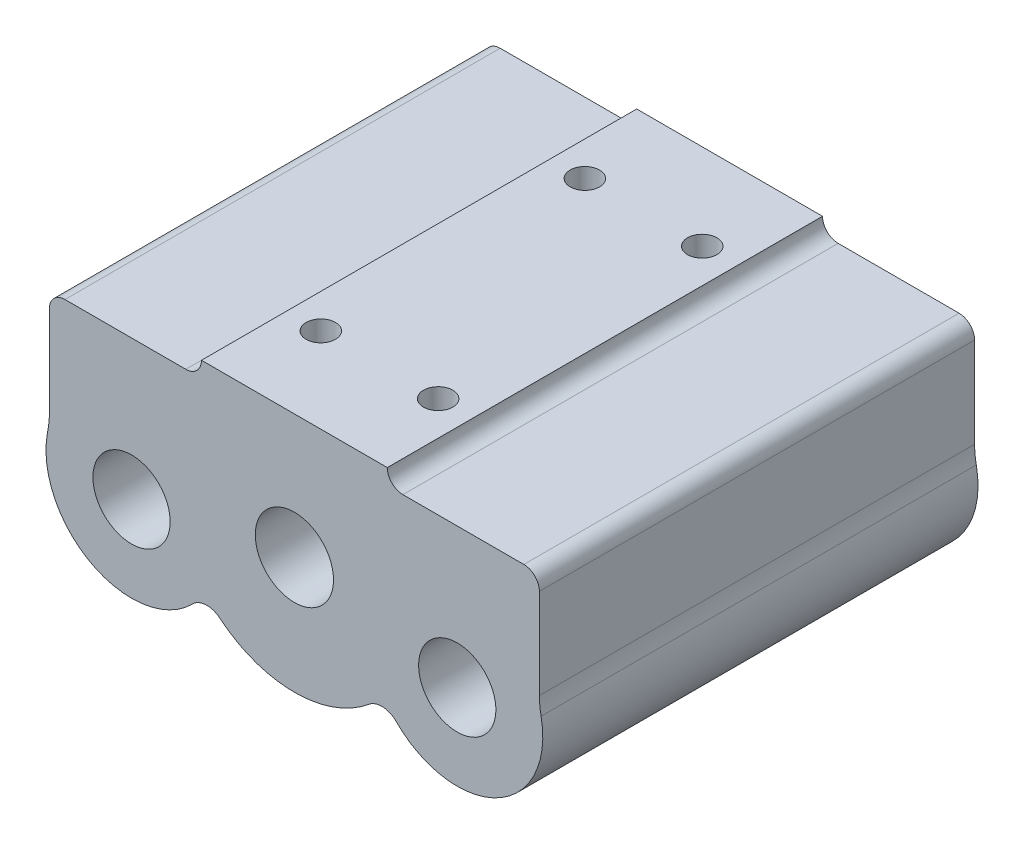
ISO-10303-21;
HEADER;
FILE_DESCRIPTION(('STEP AP214'),'2;1');
FILE_NAME('part.step','',(''),(''),'','','');
FILE_SCHEMA(('AUTOMOTIVE_DESIGN { 1 0 10303 214 1 1 1 1 }'));
ENDSEC;
DATA;
#1=APPLICATION_CONTEXT('core data for automotive mechanical design processes');
#2=APPLICATION_PROTOCOL_DEFINITION('international standard','automotive_design',2000,#1);
#3=PRODUCT_CONTEXT('',#1,'mechanical');
#4=PRODUCT('Part','Part','',(#3));
#5=PRODUCT_RELATED_PRODUCT_CATEGORY('part','',(#4));
#6=PRODUCT_DEFINITION_FORMATION('','',#4);
#7=PRODUCT_DEFINITION_CONTEXT('part definition',#1,'design');
#8=PRODUCT_DEFINITION('design','',#6,#7);
#9=PRODUCT_DEFINITION_SHAPE('','',#8);
#10=(LENGTH_UNIT() NAMED_UNIT(*) SI_UNIT(.MILLI.,.METRE.));
#11=(NAMED_UNIT(*) PLANE_ANGLE_UNIT() SI_UNIT($,.RADIAN.));
#12=(NAMED_UNIT(*) SI_UNIT($,.STERADIAN.) SOLID_ANGLE_UNIT());
#13=UNCERTAINTY_MEASURE_WITH_UNIT(LENGTH_MEASURE(1.E-05),#10,'distance_accuracy_value','');
#14=(GEOMETRIC_REPRESENTATION_CONTEXT(3) GLOBAL_UNCERTAINTY_ASSIGNED_CONTEXT((#13)) GLOBAL_UNIT_ASSIGNED_CONTEXT((#10,
#11,#12)) REPRESENTATION_CONTEXT('',''));
#15=CARTESIAN_POINT('',(0.,0.,0.));
#16=DIRECTION('',(0.,0.,1.));
#17=DIRECTION('',(1.,0.,0.));
#18=AXIS2_PLACEMENT_3D('',#15,#16,#17);
#19=CARTESIAN_POINT('',(0.015142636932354,9.47150974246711E-11,-458.552500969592));
#20=DIRECTION('',(0.,0.,1.));
#21=DIRECTION('',(1.,0.,0.));
#22=AXIS2_PLACEMENT_3D('',#19,#20,#21);
#23=CYLINDRICAL_SURFACE('',#22,4.);
#24=CARTESIAN_POINT('',(0.015142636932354,9.47150974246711E-11,-414.050500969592));
#25=DIRECTION('',(0.,0.,1.));
#26=DIRECTION('',(1.,0.,0.));
#27=AXIS2_PLACEMENT_3D('',#24,#25,#26);
#28=CIRCLE('',#27,4.);
#29=CARTESIAN_POINT('',(4.01514263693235,9.47150974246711E-11,-414.050500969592));
#30=VERTEX_POINT('',#29);
#31=EDGE_CURVE('E309',#30,#30,#28,.T.);
#32=ORIENTED_EDGE('',*,*,#31,.T.);
#33=EDGE_LOOP('',(#32));
#34=FACE_BOUND('',#33,.T.);
#35=CARTESIAN_POINT('',(0.015142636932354,9.47150974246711E-11,-436.300500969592));
#36=DIRECTION('',(0.,0.,-1.));
#37=DIRECTION('',(-1.,0.,0.));
#38=AXIS2_PLACEMENT_3D('',#35,#36,#37);
#39=CIRCLE('',#38,4.);
#40=CARTESIAN_POINT('',(-3.98485736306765,9.47150974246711E-11,-436.300500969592));
#41=VERTEX_POINT('',#40);
#42=EDGE_CURVE('E11',#41,#41,#39,.F.);
#43=ORIENTED_EDGE('',*,*,#42,.F.);
#44=EDGE_LOOP('',(#43));
#45=FACE_BOUND('',#44,.T.);
#46=ADVANCED_FACE('F36',(#34,#45),#23,.F.);
#47=CARTESIAN_POINT('',(-33.7848573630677,0.282456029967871,-515.017202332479));
#48=DIRECTION('',(0.,0.,1.));
#49=DIRECTION('',(1.,0.,0.));
#50=AXIS2_PLACEMENT_3D('',#47,#48,#49);
#51=CYLINDRICAL_SURFACE('',#50,8.75000000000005);
#52=CARTESIAN_POINT('',(-33.7848573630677,0.282456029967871,-458.552500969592));
#53=DIRECTION('',(0.,0.,1.));
#54=DIRECTION('',(1.,0.,0.));
#55=AXIS2_PLACEMENT_3D('',#52,#53,#54);
#56=CIRCLE('',#55,8.75000000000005);
#57=CARTESIAN_POINT('',(-25.2098573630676,-1.45877198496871,-458.552500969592));
#58=VERTEX_POINT('',#57);
#59=CARTESIAN_POINT('',(-25.0348573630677,0.282456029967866,-458.552500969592));
#60=VERTEX_POINT('',#59);
#61=EDGE_CURVE('E137',#58,#60,#56,.T.);
#62=ORIENTED_EDGE('',*,*,#61,.F.);
#63=DIRECTION('',(0.,0.,1.));
#64=VECTOR('',#63,1.);
#65=CARTESIAN_POINT('',(-25.2098573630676,-1.45877198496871,-515.017202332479));
#66=LINE('',#65,#64);
#67=CARTESIAN_POINT('',(-25.2098573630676,-1.45877198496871,-414.050500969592));
#68=VERTEX_POINT('',#67);
#69=EDGE_CURVE('E134',#58,#68,#66,.T.);
#70=ORIENTED_EDGE('',*,*,#69,.T.);
#71=CARTESIAN_POINT('',(-33.7848573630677,0.282456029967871,-414.050500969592));
#72=DIRECTION('',(0.,0.,-1.));
#73=DIRECTION('',(-1.,0.,0.));
#74=AXIS2_PLACEMENT_3D('',#71,#72,#73);
#75=CIRCLE('',#74,8.75000000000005);
#76=CARTESIAN_POINT('',(-25.0348573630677,0.282456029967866,-414.050500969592));
#77=VERTEX_POINT('',#76);
#78=EDGE_CURVE('E145',#77,#68,#75,.T.);
#79=ORIENTED_EDGE('',*,*,#78,.F.);
#80=DIRECTION('',(0.,0.,1.));
#81=VECTOR('',#80,1.);
#82=CARTESIAN_POINT('',(-25.0348573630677,0.282456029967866,-515.017202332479));
#83=LINE('',#82,#81);
#84=EDGE_CURVE('E190',#60,#77,#83,.T.);
#85=ORIENTED_EDGE('',*,*,#84,.F.);
#86=EDGE_LOOP('',(#62,#70,#79,#85));
#87=FACE_BOUND('',#86,.T.);
#88=ADVANCED_FACE('F38',(#87),#51,.F.);
#89=CARTESIAN_POINT('',(-25.0348573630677,0.282456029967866,-515.017202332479));
#90=DIRECTION('',(-1.,0.,0.));
#91=DIRECTION('',(0.,-1.,0.));
#92=AXIS2_PLACEMENT_3D('',#89,#90,#91);
#93=PLANE('',#92);
#94=DIRECTION('',(0.,1.,0.));
#95=VECTOR('',#94,1.);
#96=CARTESIAN_POINT('',(-25.0348573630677,0.282456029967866,-458.552500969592));
#97=LINE('',#96,#95);
#98=CARTESIAN_POINT('',(-25.0348573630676,9.51250000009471,-458.552500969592));
#99=VERTEX_POINT('',#98);
#100=EDGE_CURVE('E138',#60,#99,#97,.T.);
#101=ORIENTED_EDGE('',*,*,#100,.F.);
#102=ORIENTED_EDGE('',*,*,#84,.T.);
#103=DIRECTION('',(0.,-1.,0.));
#104=VECTOR('',#103,1.);
#105=CARTESIAN_POINT('',(-25.0348573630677,0.282456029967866,-414.050500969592));
#106=LINE('',#105,#104);
#107=CARTESIAN_POINT('',(-25.0348573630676,9.51250000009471,-414.050500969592));
#108=VERTEX_POINT('',#107);
#109=EDGE_CURVE('E136',#108,#77,#106,.T.);
#110=ORIENTED_EDGE('',*,*,#109,.F.);
#111=DIRECTION('',(0.,0.,1.));
#112=VECTOR('',#111,1.);
#113=CARTESIAN_POINT('',(-25.0348573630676,9.51250000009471,-515.017202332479));
#114=LINE('',#113,#112);
#115=EDGE_CURVE('E193',#99,#108,#114,.T.);
#116=ORIENTED_EDGE('',*,*,#115,.F.);
#117=EDGE_LOOP('',(#101,#102,#110,#116));
#118=FACE_BOUND('',#117,.T.);
#119=ADVANCED_FACE('F283',(#118),#93,.T.);
#120=CARTESIAN_POINT('',(-23.4473573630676,9.51250000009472,-515.017202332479));
#121=DIRECTION('',(0.,0.,1.));
#122=DIRECTION('',(1.,0.,0.));
#123=AXIS2_PLACEMENT_3D('',#120,#121,#122);
#124=CYLINDRICAL_SURFACE('',#123,1.58749999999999);
#125=CARTESIAN_POINT('',(-23.4473573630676,9.51250000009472,-458.552500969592));
#126=DIRECTION('',(0.,0.,1.));
#127=DIRECTION('',(1.,0.,0.));
#128=AXIS2_PLACEMENT_3D('',#125,#126,#127);
#129=CIRCLE('',#128,1.58749999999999);
#130=CARTESIAN_POINT('',(-23.4473573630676,11.1000000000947,-458.552500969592));
#131=VERTEX_POINT('',#130);
#132=EDGE_CURVE('E141',#99,#131,#129,.F.);
#133=ORIENTED_EDGE('',*,*,#132,.F.);
#134=ORIENTED_EDGE('',*,*,#115,.T.);
#135=CARTESIAN_POINT('',(-23.4473573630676,9.51250000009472,-414.050500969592));
#136=DIRECTION('',(0.,0.,1.));
#137=DIRECTION('',(-1.,0.,0.));
#138=AXIS2_PLACEMENT_3D('',#135,#136,#137);
#139=CIRCLE('',#138,1.58749999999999);
#140=CARTESIAN_POINT('',(-23.4473573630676,11.1000000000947,-414.050500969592));
#141=VERTEX_POINT('',#140);
#142=EDGE_CURVE('E185',#141,#108,#139,.T.);
#143=ORIENTED_EDGE('',*,*,#142,.F.);
#144=DIRECTION('',(0.,0.,1.));
#145=VECTOR('',#144,1.);
#146=CARTESIAN_POINT('',(-23.4473573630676,11.1000000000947,-515.017202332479));
#147=LINE('',#146,#145);
#148=EDGE_CURVE('E196',#131,#141,#147,.T.);
#149=ORIENTED_EDGE('',*,*,#148,.F.);
#150=EDGE_LOOP('',(#133,#134,#143,#149));
#151=FACE_BOUND('',#150,.T.);
#152=ADVANCED_FACE('F286',(#151),#124,.T.);
#153=CARTESIAN_POINT('',(-23.4473573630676,11.1000000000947,-515.017202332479));
#154=DIRECTION('',(0.,1.,0.));
#155=DIRECTION('',(-1.,0.,0.));
#156=AXIS2_PLACEMENT_3D('',#153,#154,#155);
#157=PLANE('',#156);
#158=DIRECTION('',(1.,0.,0.));
#159=VECTOR('',#158,1.);
#160=CARTESIAN_POINT('',(-23.4473573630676,11.1000000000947,-458.552500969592));
#161=LINE('',#160,#159);
#162=CARTESIAN_POINT('',(-11.0848573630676,11.1000000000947,-458.552500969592));
#163=VERTEX_POINT('',#162);
#164=EDGE_CURVE('E289',#131,#163,#161,.T.);
#165=ORIENTED_EDGE('',*,*,#164,.F.);
#166=ORIENTED_EDGE('',*,*,#148,.T.);
#167=DIRECTION('',(-1.,0.,0.));
#168=VECTOR('',#167,1.);
#169=CARTESIAN_POINT('',(-23.4473573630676,11.1000000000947,-414.050500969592));
#170=LINE('',#169,#168);
#171=CARTESIAN_POINT('',(-11.0848573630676,11.1000000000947,-414.050500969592));
#172=VERTEX_POINT('',#171);
#173=EDGE_CURVE('E182',#172,#141,#170,.T.);
#174=ORIENTED_EDGE('',*,*,#173,.F.);
#175=DIRECTION('',(0.,0.,1.));
#176=VECTOR('',#175,1.);
#177=CARTESIAN_POINT('',(-11.0848573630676,11.1000000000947,-515.017202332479));
#178=LINE('',#177,#176);
#179=EDGE_CURVE('E199',#163,#172,#178,.T.);
#180=ORIENTED_EDGE('',*,*,#179,.F.);
#181=EDGE_LOOP('',(#165,#166,#174,#180));
#182=FACE_BOUND('',#181,.T.);
#183=ADVANCED_FACE('F476',(#182),#157,.T.);
#184=CARTESIAN_POINT('',(-11.0848573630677,12.7000000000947,-515.017202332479));
#185=DIRECTION('',(0.,0.,1.));
#186=DIRECTION('',(1.,0.,0.));
#187=AXIS2_PLACEMENT_3D('',#184,#185,#186);
#188=CYLINDRICAL_SURFACE('',#187,1.6);
#189=CARTESIAN_POINT('',(-11.0848573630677,12.7000000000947,-458.552500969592));
#190=DIRECTION('',(0.,0.,1.));
#191=DIRECTION('',(1.,0.,0.));
#192=AXIS2_PLACEMENT_3D('',#189,#190,#191);
#193=CIRCLE('',#192,1.6);
#194=CARTESIAN_POINT('',(-9.48485736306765,12.7000000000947,-458.552500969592));
#195=VERTEX_POINT('',#194);
#196=EDGE_CURVE('E290',#163,#195,#193,.T.);
#197=ORIENTED_EDGE('',*,*,#196,.F.);
#198=ORIENTED_EDGE('',*,*,#179,.T.);
#199=CARTESIAN_POINT('',(-11.0848573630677,12.7000000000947,-414.050500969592));
#200=DIRECTION('',(0.,0.,-1.));
#201=DIRECTION('',(1.,0.,0.));
#202=AXIS2_PLACEMENT_3D('',#199,#200,#201);
#203=CIRCLE('',#202,1.6);
#204=CARTESIAN_POINT('',(-9.48485736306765,12.7000000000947,-414.050500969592));
#205=VERTEX_POINT('',#204);
#206=EDGE_CURVE('E179',#205,#172,#203,.T.);
#207=ORIENTED_EDGE('',*,*,#206,.F.);
#208=DIRECTION('',(0.,0.,1.));
#209=VECTOR('',#208,1.);
#210=CARTESIAN_POINT('',(-9.48485736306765,12.7000000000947,-515.017202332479));
#211=LINE('',#210,#209);
#212=EDGE_CURVE('E202',#195,#205,#211,.T.);
#213=ORIENTED_EDGE('',*,*,#212,.F.);
#214=EDGE_LOOP('',(#197,#198,#207,#213));
#215=FACE_BOUND('',#214,.T.);
#216=ADVANCED_FACE('F398',(#215),#188,.F.);
#217=CARTESIAN_POINT('',(9.51514263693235,12.7000000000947,-515.017202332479));
#218=DIRECTION('',(0.,1.,0.));
#219=DIRECTION('',(-1.,0.,0.));
#220=AXIS2_PLACEMENT_3D('',#217,#218,#219);
#221=PLANE('',#220);
#222=CARTESIAN_POINT('',(-5.98485736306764,12.7000000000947,-422.750500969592));
#223=DIRECTION('',(0.,1.,0.));
#224=DIRECTION('',(0.,0.,1.));
#225=AXIS2_PLACEMENT_3D('',#222,#223,#224);
#226=CIRCLE('',#225,1.5);
#227=CARTESIAN_POINT('',(-5.98485736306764,12.7000000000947,-421.250500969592));
#228=VERTEX_POINT('',#227);
#229=EDGE_CURVE('E360',#228,#228,#226,.T.);
#230=ORIENTED_EDGE('',*,*,#229,.F.);
#231=EDGE_LOOP('',(#230));
#232=FACE_BOUND('',#231,.T.);
#233=CARTESIAN_POINT('',(-5.98485736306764,12.7000000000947,-449.750500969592));
#234=DIRECTION('',(0.,1.,0.));
#235=DIRECTION('',(0.,0.,1.));
#236=AXIS2_PLACEMENT_3D('',#233,#234,#235);
#237=CIRCLE('',#236,1.5);
#238=CARTESIAN_POINT('',(-5.98485736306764,12.7000000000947,-448.250500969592));
#239=VERTEX_POINT('',#238);
#240=EDGE_CURVE('E348',#239,#239,#237,.T.);
#241=ORIENTED_EDGE('',*,*,#240,.F.);
#242=EDGE_LOOP('',(#241));
#243=FACE_BOUND('',#242,.T.);
#244=CARTESIAN_POINT('',(6.01514263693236,12.7000000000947,-449.750500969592));
#245=DIRECTION('',(0.,1.,0.));
#246=DIRECTION('',(0.,0.,1.));
#247=AXIS2_PLACEMENT_3D('',#244,#245,#246);
#248=CIRCLE('',#247,1.5);
#249=CARTESIAN_POINT('',(6.01514263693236,12.7000000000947,-448.250500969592));
#250=VERTEX_POINT('',#249);
#251=EDGE_CURVE('E336',#250,#250,#248,.T.);
#252=ORIENTED_EDGE('',*,*,#251,.F.);
#253=EDGE_LOOP('',(#252));
#254=FACE_BOUND('',#253,.T.);
#255=CARTESIAN_POINT('',(6.01514263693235,12.7000000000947,-422.750500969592));
#256=DIRECTION('',(0.,1.,0.));
#257=DIRECTION('',(0.,0.,1.));
#258=AXIS2_PLACEMENT_3D('',#255,#256,#257);
#259=CIRCLE('',#258,1.5);
#260=CARTESIAN_POINT('',(6.01514263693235,12.7000000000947,-421.250500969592));
#261=VERTEX_POINT('',#260);
#262=EDGE_CURVE('E322',#261,#261,#259,.T.);
#263=ORIENTED_EDGE('',*,*,#262,.F.);
#264=EDGE_LOOP('',(#263));
#265=FACE_BOUND('',#264,.T.);
#266=DIRECTION('',(1.,0.,0.));
#267=VECTOR('',#266,1.);
#268=CARTESIAN_POINT('',(9.51514263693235,12.7000000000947,-458.552500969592));
#269=LINE('',#268,#267);
#270=CARTESIAN_POINT('',(9.51514263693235,12.7000000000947,-458.552500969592));
#271=VERTEX_POINT('',#270);
#272=EDGE_CURVE('E294',#195,#271,#269,.T.);
#273=ORIENTED_EDGE('',*,*,#272,.F.);
#274=ORIENTED_EDGE('',*,*,#212,.T.);
#275=DIRECTION('',(-1.,0.,0.));
#276=VECTOR('',#275,1.);
#277=CARTESIAN_POINT('',(9.51514263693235,12.7000000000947,-414.050500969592));
#278=LINE('',#277,#276);
#279=CARTESIAN_POINT('',(9.51514263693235,12.7000000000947,-414.050500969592));
#280=VERTEX_POINT('',#279);
#281=EDGE_CURVE('E176',#280,#205,#278,.T.);
#282=ORIENTED_EDGE('',*,*,#281,.F.);
#283=DIRECTION('',(0.,0.,1.));
#284=VECTOR('',#283,1.);
#285=CARTESIAN_POINT('',(9.51514263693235,12.7000000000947,-515.017202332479));
#286=LINE('',#285,#284);
#287=EDGE_CURVE('E205',#271,#280,#286,.T.);
#288=ORIENTED_EDGE('',*,*,#287,.F.);
#289=EDGE_LOOP('',(#273,#274,#282,#288));
#290=FACE_BOUND('',#289,.T.);
#291=ADVANCED_FACE('F394',(#232,#243,#254,#265,#290),#221,.T.);
#292=CARTESIAN_POINT('',(11.1151426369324,12.7000000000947,-515.017202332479));
#293=DIRECTION('',(0.,0.,1.));
#294=DIRECTION('',(1.,0.,0.));
#295=AXIS2_PLACEMENT_3D('',#292,#293,#294);
#296=CYLINDRICAL_SURFACE('',#295,1.6);
#297=CARTESIAN_POINT('',(11.1151426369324,12.7000000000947,-458.552500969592));
#298=DIRECTION('',(0.,0.,1.));
#299=DIRECTION('',(1.,0.,0.));
#300=AXIS2_PLACEMENT_3D('',#297,#298,#299);
#301=CIRCLE('',#300,1.6);
#302=CARTESIAN_POINT('',(11.1151426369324,11.1000000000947,-458.552500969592));
#303=VERTEX_POINT('',#302);
#304=EDGE_CURVE('E296',#271,#303,#301,.T.);
#305=ORIENTED_EDGE('',*,*,#304,.F.);
#306=ORIENTED_EDGE('',*,*,#287,.T.);
#307=CARTESIAN_POINT('',(11.1151426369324,12.7000000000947,-414.050500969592));
#308=DIRECTION('',(0.,0.,-1.));
#309=DIRECTION('',(-1.,0.,0.));
#310=AXIS2_PLACEMENT_3D('',#307,#308,#309);
#311=CIRCLE('',#310,1.6);
#312=CARTESIAN_POINT('',(11.1151426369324,11.1000000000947,-414.050500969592));
#313=VERTEX_POINT('',#312);
#314=EDGE_CURVE('E173',#313,#280,#311,.T.);
#315=ORIENTED_EDGE('',*,*,#314,.F.);
#316=DIRECTION('',(0.,0.,1.));
#317=VECTOR('',#316,1.);
#318=CARTESIAN_POINT('',(11.1151426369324,11.1000000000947,-515.017202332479));
#319=LINE('',#318,#317);
#320=EDGE_CURVE('E208',#303,#313,#319,.T.);
#321=ORIENTED_EDGE('',*,*,#320,.F.);
#322=EDGE_LOOP('',(#305,#306,#315,#321));
#323=FACE_BOUND('',#322,.T.);
#324=ADVANCED_FACE('F397',(#323),#296,.F.);
#325=CARTESIAN_POINT('',(23.4776426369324,11.1000000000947,-515.017202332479));
#326=DIRECTION('',(0.,1.,0.));
#327=DIRECTION('',(0.,0.,1.));
#328=AXIS2_PLACEMENT_3D('',#325,#326,#327);
#329=PLANE('',#328);
#330=DIRECTION('',(1.,0.,0.));
#331=VECTOR('',#330,1.);
#332=CARTESIAN_POINT('',(23.4776426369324,11.1000000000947,-458.552500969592));
#333=LINE('',#332,#331);
#334=CARTESIAN_POINT('',(23.4776426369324,11.1000000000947,-458.552500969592));
#335=VERTEX_POINT('',#334);
#336=EDGE_CURVE('E298',#303,#335,#333,.T.);
#337=ORIENTED_EDGE('',*,*,#336,.F.);
#338=ORIENTED_EDGE('',*,*,#320,.T.);
#339=DIRECTION('',(-1.,0.,0.));
#340=VECTOR('',#339,1.);
#341=CARTESIAN_POINT('',(23.4776426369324,11.1000000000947,-414.050500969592));
#342=LINE('',#341,#340);
#343=CARTESIAN_POINT('',(23.4776426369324,11.1000000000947,-414.050500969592));
#344=VERTEX_POINT('',#343);
#345=EDGE_CURVE('E170',#344,#313,#342,.T.);
#346=ORIENTED_EDGE('',*,*,#345,.F.);
#347=DIRECTION('',(0.,0.,1.));
#348=VECTOR('',#347,1.);
#349=CARTESIAN_POINT('',(23.4776426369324,11.1000000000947,-515.017202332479));
#350=LINE('',#349,#348);
#351=EDGE_CURVE('E211',#335,#344,#350,.T.);
#352=ORIENTED_EDGE('',*,*,#351,.F.);
#353=EDGE_LOOP('',(#337,#338,#346,#352));
#354=FACE_BOUND('',#353,.T.);
#355=ADVANCED_FACE('F424',(#354),#329,.T.);
#356=CARTESIAN_POINT('',(23.4776426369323,9.51250000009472,-515.017202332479));
#357=DIRECTION('',(0.,0.,1.));
#358=DIRECTION('',(1.,0.,0.));
#359=AXIS2_PLACEMENT_3D('',#356,#357,#358);
#360=CYLINDRICAL_SURFACE('',#359,1.5875);
#361=CARTESIAN_POINT('',(23.4776426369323,9.51250000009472,-458.552500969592));
#362=DIRECTION('',(0.,0.,1.));
#363=DIRECTION('',(1.,0.,0.));
#364=AXIS2_PLACEMENT_3D('',#361,#362,#363);
#365=CIRCLE('',#364,1.5875);
#366=CARTESIAN_POINT('',(25.0651426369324,9.51250000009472,-458.552500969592));
#367=VERTEX_POINT('',#366);
#368=EDGE_CURVE('E300',#335,#367,#365,.F.);
#369=ORIENTED_EDGE('',*,*,#368,.F.);
#370=ORIENTED_EDGE('',*,*,#351,.T.);
#371=CARTESIAN_POINT('',(23.4776426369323,9.51250000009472,-414.050500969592));
#372=DIRECTION('',(0.,0.,1.));
#373=DIRECTION('',(1.,0.,0.));
#374=AXIS2_PLACEMENT_3D('',#371,#372,#373);
#375=CIRCLE('',#374,1.5875);
#376=CARTESIAN_POINT('',(25.0651426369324,9.51250000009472,-414.050500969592));
#377=VERTEX_POINT('',#376);
#378=EDGE_CURVE('E167',#377,#344,#375,.T.);
#379=ORIENTED_EDGE('',*,*,#378,.F.);
#380=DIRECTION('',(0.,0.,1.));
#381=VECTOR('',#380,1.);
#382=CARTESIAN_POINT('',(25.0651426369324,9.51250000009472,-515.017202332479));
#383=LINE('',#382,#381);
#384=EDGE_CURVE('E214',#367,#377,#383,.T.);
#385=ORIENTED_EDGE('',*,*,#384,.F.);
#386=EDGE_LOOP('',(#369,#370,#379,#385));
#387=FACE_BOUND('',#386,.T.);
#388=ADVANCED_FACE('F427',(#387),#360,.T.);
#389=CARTESIAN_POINT('',(25.0651426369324,0.282456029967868,-515.017202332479));
#390=DIRECTION('',(1.,0.,0.));
#391=DIRECTION('',(0.,1.,0.));
#392=AXIS2_PLACEMENT_3D('',#389,#390,#391);
#393=PLANE('',#392);
#394=DIRECTION('',(0.,-1.,0.));
#395=VECTOR('',#394,1.);
#396=CARTESIAN_POINT('',(25.0651426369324,0.282456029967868,-458.552500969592));
#397=LINE('',#396,#395);
#398=CARTESIAN_POINT('',(25.0651426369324,0.282456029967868,-458.552500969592));
#399=VERTEX_POINT('',#398);
#400=EDGE_CURVE('E302',#367,#399,#397,.T.);
#401=ORIENTED_EDGE('',*,*,#400,.F.);
#402=ORIENTED_EDGE('',*,*,#384,.T.);
#403=DIRECTION('',(0.,1.,0.));
#404=VECTOR('',#403,1.);
#405=CARTESIAN_POINT('',(25.0651426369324,0.282456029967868,-414.050500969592));
#406=LINE('',#405,#404);
#407=CARTESIAN_POINT('',(25.0651426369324,0.282456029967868,-414.050500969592));
#408=VERTEX_POINT('',#407);
#409=EDGE_CURVE('E164',#408,#377,#406,.T.);
#410=ORIENTED_EDGE('',*,*,#409,.F.);
#411=DIRECTION('',(0.,0.,1.));
#412=VECTOR('',#411,1.);
#413=CARTESIAN_POINT('',(25.0651426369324,0.282456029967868,-515.017202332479));
#414=LINE('',#413,#412);
#415=EDGE_CURVE('E217',#399,#408,#414,.T.);
#416=ORIENTED_EDGE('',*,*,#415,.F.);
#417=EDGE_LOOP('',(#401,#402,#410,#416));
#418=FACE_BOUND('',#417,.T.);
#419=ADVANCED_FACE('F431',(#418),#393,.T.);
#420=CARTESIAN_POINT('',(33.8151426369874,0.282456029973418,-515.017202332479));
#421=DIRECTION('',(0.,0.,1.));
#422=DIRECTION('',(1.,0.,0.));
#423=AXIS2_PLACEMENT_3D('',#420,#421,#422);
#424=CYLINDRICAL_SURFACE('',#423,8.75000000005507);
#425=CARTESIAN_POINT('',(33.8151426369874,0.282456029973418,-458.552500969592));
#426=DIRECTION('',(0.,0.,1.));
#427=DIRECTION('',(1.,0.,0.));
#428=AXIS2_PLACEMENT_3D('',#425,#426,#427);
#429=CIRCLE('',#428,8.75000000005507);
#430=CARTESIAN_POINT('',(25.2401426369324,-1.45877198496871,-458.552500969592));
#431=VERTEX_POINT('',#430);
#432=EDGE_CURVE('E304',#399,#431,#429,.T.);
#433=ORIENTED_EDGE('',*,*,#432,.F.);
#434=ORIENTED_EDGE('',*,*,#415,.T.);
#435=CARTESIAN_POINT('',(33.8151426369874,0.282456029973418,-414.050500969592));
#436=DIRECTION('',(0.,0.,-1.));
#437=DIRECTION('',(-1.,0.,0.));
#438=AXIS2_PLACEMENT_3D('',#435,#436,#437);
#439=CIRCLE('',#438,8.75000000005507);
#440=CARTESIAN_POINT('',(25.2401426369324,-1.45877198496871,-414.050500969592));
#441=VERTEX_POINT('',#440);
#442=EDGE_CURVE('E161',#441,#408,#439,.T.);
#443=ORIENTED_EDGE('',*,*,#442,.F.);
#444=DIRECTION('',(0.,0.,1.));
#445=VECTOR('',#444,1.);
#446=CARTESIAN_POINT('',(25.2401426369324,-1.45877198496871,-515.017202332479));
#447=LINE('',#446,#445);
#448=EDGE_CURVE('E126',#431,#441,#447,.T.);
#449=ORIENTED_EDGE('',*,*,#448,.F.);
#450=EDGE_LOOP('',(#433,#434,#443,#449));
#451=FACE_BOUND('',#450,.T.);
#452=ADVANCED_FACE('F231',(#451),#424,.F.);
#453=CARTESIAN_POINT('',(16.6651426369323,-3.19999999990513,-515.017202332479));
#454=DIRECTION('',(0.,0.,1.));
#455=DIRECTION('',(1.,0.,0.));
#456=AXIS2_PLACEMENT_3D('',#453,#454,#455);
#457=CYLINDRICAL_SURFACE('',#456,8.75000000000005);
#458=CARTESIAN_POINT('',(16.6651426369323,-3.19999999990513,-458.552500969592));
#459=DIRECTION('',(0.,0.,1.));
#460=DIRECTION('',(1.,0.,0.));
#461=AXIS2_PLACEMENT_3D('',#458,#459,#460);
#462=CIRCLE('',#461,8.75000000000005);
#463=CARTESIAN_POINT('',(10.4302529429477,-9.33910828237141,-458.552500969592));
#464=VERTEX_POINT('',#463);
#465=EDGE_CURVE('E102',#431,#464,#462,.F.);
#466=ORIENTED_EDGE('',*,*,#465,.F.);
#467=ORIENTED_EDGE('',*,*,#448,.T.);
#468=CARTESIAN_POINT('',(16.6651426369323,-3.19999999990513,-414.050500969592));
#469=DIRECTION('',(0.,0.,1.));
#470=DIRECTION('',(1.,0.,0.));
#471=AXIS2_PLACEMENT_3D('',#468,#469,#470);
#472=CIRCLE('',#471,8.75000000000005);
#473=CARTESIAN_POINT('',(10.4302529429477,-9.33910828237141,-414.050500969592));
#474=VERTEX_POINT('',#473);
#475=EDGE_CURVE('E158',#474,#441,#472,.T.);
#476=ORIENTED_EDGE('',*,*,#475,.F.);
#477=DIRECTION('',(0.,0.,1.));
#478=VECTOR('',#477,1.);
#479=CARTESIAN_POINT('',(10.4302529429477,-9.33910828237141,-515.017202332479));
#480=LINE('',#479,#478);
#481=EDGE_CURVE('E124',#464,#474,#480,.T.);
#482=ORIENTED_EDGE('',*,*,#481,.F.);
#483=EDGE_LOOP('',(#466,#467,#476,#482));
#484=FACE_BOUND('',#483,.T.);
#485=ADVANCED_FACE('F225',(#484),#457,.T.);
#486=CARTESIAN_POINT('',(8.96024409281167,-10.7865346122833,-515.017202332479));
#487=DIRECTION('',(0.,0.,1.));
#488=DIRECTION('',(1.,0.,0.));
#489=AXIS2_PLACEMENT_3D('',#486,#487,#488);
#490=CYLINDRICAL_SURFACE('',#489,2.06300000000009);
#491=CARTESIAN_POINT('',(8.96024409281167,-10.7865346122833,-458.552500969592));
#492=DIRECTION('',(0.,0.,1.));
#493=DIRECTION('',(1.,0.,0.));
#494=AXIS2_PLACEMENT_3D('',#491,#492,#493);
#495=CIRCLE('',#494,2.06300000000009);
#496=CARTESIAN_POINT('',(7.64334233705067,-9.19853626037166,-458.552500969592));
#497=VERTEX_POINT('',#496);
#498=EDGE_CURVE('E96',#464,#497,#495,.T.);
#499=ORIENTED_EDGE('',*,*,#498,.F.);
#500=ORIENTED_EDGE('',*,*,#481,.T.);
#501=CARTESIAN_POINT('',(8.96024409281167,-10.7865346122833,-414.050500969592));
#502=DIRECTION('',(0.,0.,-1.));
#503=DIRECTION('',(-1.,0.,0.));
#504=AXIS2_PLACEMENT_3D('',#501,#502,#503);
#505=CIRCLE('',#504,2.06300000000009);
#506=CARTESIAN_POINT('',(7.64334233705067,-9.19853626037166,-414.050500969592));
#507=VERTEX_POINT('',#506);
#508=EDGE_CURVE('E122',#507,#474,#505,.T.);
#509=ORIENTED_EDGE('',*,*,#508,.F.);
#510=DIRECTION('',(0.,0.,1.));
#511=VECTOR('',#510,1.);
#512=CARTESIAN_POINT('',(7.64334233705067,-9.19853626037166,-515.017202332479));
#513=LINE('',#512,#511);
#514=EDGE_CURVE('E114',#497,#507,#513,.T.);
#515=ORIENTED_EDGE('',*,*,#514,.F.);
#516=EDGE_LOOP('',(#499,#500,#509,#515));
#517=FACE_BOUND('',#516,.T.);
#518=ADVANCED_FACE('F120',(#517),#490,.F.);
#519=CARTESIAN_POINT('',(0.0151426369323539,9.46472417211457E-11,-515.017202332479));
#520=DIRECTION('',(0.,0.,1.));
#521=DIRECTION('',(1.,0.,0.));
#522=AXIS2_PLACEMENT_3D('',#519,#520,#521);
#523=CYLINDRICAL_SURFACE('',#522,11.9499999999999);
#524=CARTESIAN_POINT('',(0.0151426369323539,9.46472417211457E-11,-458.552500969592));
#525=DIRECTION('',(0.,0.,1.));
#526=DIRECTION('',(1.,0.,0.));
#527=AXIS2_PLACEMENT_3D('',#524,#525,#526);
#528=CIRCLE('',#527,11.9499999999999);
#529=CARTESIAN_POINT('',(-7.61305706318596,-9.19853626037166,-458.552500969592));
#530=VERTEX_POINT('',#529);
#531=EDGE_CURVE('E99',#497,#530,#528,.F.);
#532=ORIENTED_EDGE('',*,*,#531,.F.);
#533=ORIENTED_EDGE('',*,*,#514,.T.);
#534=CARTESIAN_POINT('',(0.0151426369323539,9.46472417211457E-11,-414.050500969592));
#535=DIRECTION('',(0.,0.,1.));
#536=DIRECTION('',(1.,0.,0.));
#537=AXIS2_PLACEMENT_3D('',#534,#535,#536);
#538=CIRCLE('',#537,11.9499999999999);
#539=CARTESIAN_POINT('',(-7.61305706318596,-9.19853626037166,-414.050500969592));
#540=VERTEX_POINT('',#539);
#541=EDGE_CURVE('E155',#540,#507,#538,.T.);
#542=ORIENTED_EDGE('',*,*,#541,.F.);
#543=DIRECTION('',(0.,0.,1.));
#544=VECTOR('',#543,1.);
#545=CARTESIAN_POINT('',(-7.61305706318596,-9.19853626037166,-515.017202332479));
#546=LINE('',#545,#544);
#547=EDGE_CURVE('E117',#530,#540,#546,.T.);
#548=ORIENTED_EDGE('',*,*,#547,.F.);
#549=EDGE_LOOP('',(#532,#533,#542,#548));
#550=FACE_BOUND('',#549,.T.);
#551=ADVANCED_FACE('F111',(#550),#523,.T.);
#552=CARTESIAN_POINT('',(-8.92995881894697,-10.7865346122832,-515.017202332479));
#553=DIRECTION('',(0.,0.,1.));
#554=DIRECTION('',(1.,0.,0.));
#555=AXIS2_PLACEMENT_3D('',#552,#553,#554);
#556=CYLINDRICAL_SURFACE('',#555,2.06300000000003);
#557=CARTESIAN_POINT('',(-8.92995881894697,-10.7865346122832,-458.552500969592));
#558=DIRECTION('',(0.,0.,1.));
#559=DIRECTION('',(1.,0.,0.));
#560=AXIS2_PLACEMENT_3D('',#557,#558,#559);
#561=CIRCLE('',#560,2.06300000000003);
#562=CARTESIAN_POINT('',(-10.399967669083,-9.33910828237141,-458.552500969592));
#563=VERTEX_POINT('',#562);
#564=EDGE_CURVE('E118',#530,#563,#561,.T.);
#565=ORIENTED_EDGE('',*,*,#564,.F.);
#566=ORIENTED_EDGE('',*,*,#547,.T.);
#567=CARTESIAN_POINT('',(-8.92995881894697,-10.7865346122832,-414.050500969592));
#568=DIRECTION('',(0.,0.,-1.));
#569=DIRECTION('',(-1.,0.,0.));
#570=AXIS2_PLACEMENT_3D('',#567,#568,#569);
#571=CIRCLE('',#570,2.06300000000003);
#572=CARTESIAN_POINT('',(-10.399967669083,-9.33910828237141,-414.050500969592));
#573=VERTEX_POINT('',#572);
#574=EDGE_CURVE('E152',#573,#540,#571,.T.);
#575=ORIENTED_EDGE('',*,*,#574,.F.);
#576=DIRECTION('',(0.,0.,1.));
#577=VECTOR('',#576,1.);
#578=CARTESIAN_POINT('',(-10.399967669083,-9.33910828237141,-515.017202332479));
#579=LINE('',#578,#577);
#580=EDGE_CURVE('E128',#563,#573,#579,.T.);
#581=ORIENTED_EDGE('',*,*,#580,.F.);
#582=EDGE_LOOP('',(#565,#566,#575,#581));
#583=FACE_BOUND('',#582,.T.);
#584=ADVANCED_FACE('F266',(#583),#556,.F.);
#585=CARTESIAN_POINT('',(-16.6348573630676,-3.19999999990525,-515.017202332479));
#586=DIRECTION('',(0.,0.,1.));
#587=DIRECTION('',(1.,0.,0.));
#588=AXIS2_PLACEMENT_3D('',#585,#586,#587);
#589=CYLINDRICAL_SURFACE('',#588,8.75000000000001);
#590=CARTESIAN_POINT('',(-16.6348573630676,-3.19999999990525,-458.552500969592));
#591=DIRECTION('',(0.,0.,1.));
#592=DIRECTION('',(1.,0.,0.));
#593=AXIS2_PLACEMENT_3D('',#590,#591,#592);
#594=CIRCLE('',#593,8.75000000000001);
#595=EDGE_CURVE('E46',#563,#58,#594,.F.);
#596=ORIENTED_EDGE('',*,*,#595,.F.);
#597=ORIENTED_EDGE('',*,*,#580,.T.);
#598=CARTESIAN_POINT('',(-16.6348573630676,-3.19999999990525,-414.050500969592));
#599=DIRECTION('',(0.,0.,1.));
#600=DIRECTION('',(1.,0.,0.));
#601=AXIS2_PLACEMENT_3D('',#598,#599,#600);
#602=CIRCLE('',#601,8.75000000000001);
#603=EDGE_CURVE('E148',#68,#573,#602,.T.);
#604=ORIENTED_EDGE('',*,*,#603,.F.);
#605=ORIENTED_EDGE('',*,*,#69,.F.);
#606=EDGE_LOOP('',(#596,#597,#604,#605));
#607=FACE_BOUND('',#606,.T.);
#608=ADVANCED_FACE('F271',(#607),#589,.T.);
#609=CARTESIAN_POINT('',(-33.7848573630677,0.282456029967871,-414.050500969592));
#610=DIRECTION('',(0.,0.,-1.));
#611=DIRECTION('',(-1.,0.,0.));
#612=AXIS2_PLACEMENT_3D('',#609,#610,#611);
#613=PLANE('',#612);
#614=CARTESIAN_POINT('',(16.6651426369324,-3.19999999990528,-414.050500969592));
#615=DIRECTION('',(0.,0.,-1.));
#616=DIRECTION('',(-1.,0.,0.));
#617=AXIS2_PLACEMENT_3D('',#614,#615,#616);
#618=CIRCLE('',#617,3.95);
#619=CARTESIAN_POINT('',(12.7151426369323,-3.19999999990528,-414.050500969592));
#620=VERTEX_POINT('',#619);
#621=EDGE_CURVE('E316',#620,#620,#618,.T.);
#622=ORIENTED_EDGE('',*,*,#621,.T.);
#623=EDGE_LOOP('',(#622));
#624=FACE_BOUND('',#623,.T.);
#625=CARTESIAN_POINT('',(-16.6348573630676,-3.19999999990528,-414.050500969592));
#626=DIRECTION('',(0.,0.,-1.));
#627=DIRECTION('',(-1.,0.,0.));
#628=AXIS2_PLACEMENT_3D('',#625,#626,#627);
#629=CIRCLE('',#628,3.95);
#630=CARTESIAN_POINT('',(-20.5848573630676,-3.19999999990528,-414.050500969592));
#631=VERTEX_POINT('',#630);
#632=EDGE_CURVE('E312',#631,#631,#629,.T.);
#633=ORIENTED_EDGE('',*,*,#632,.T.);
#634=EDGE_LOOP('',(#633));
#635=FACE_BOUND('',#634,.T.);
#636=ORIENTED_EDGE('',*,*,#31,.F.);
#637=EDGE_LOOP('',(#636));
#638=FACE_BOUND('',#637,.T.);
#639=ORIENTED_EDGE('',*,*,#78,.T.);
#640=ORIENTED_EDGE('',*,*,#603,.T.);
#641=ORIENTED_EDGE('',*,*,#574,.T.);
#642=ORIENTED_EDGE('',*,*,#541,.T.);
#643=ORIENTED_EDGE('',*,*,#508,.T.);
#644=ORIENTED_EDGE('',*,*,#475,.T.);
#645=ORIENTED_EDGE('',*,*,#442,.T.);
#646=ORIENTED_EDGE('',*,*,#409,.T.);
#647=ORIENTED_EDGE('',*,*,#378,.T.);
#648=ORIENTED_EDGE('',*,*,#345,.T.);
#649=ORIENTED_EDGE('',*,*,#314,.T.);
#650=ORIENTED_EDGE('',*,*,#281,.T.);
#651=ORIENTED_EDGE('',*,*,#206,.T.);
#652=ORIENTED_EDGE('',*,*,#173,.T.);
#653=ORIENTED_EDGE('',*,*,#142,.T.);
#654=ORIENTED_EDGE('',*,*,#109,.T.);
#655=EDGE_LOOP('',(#639,#640,#641,#642,#643,#644,#645,#646,#647,#648,#649,#650,#651,#652,#653,#654));
#656=FACE_BOUND('',#655,.T.);
#657=ADVANCED_FACE('F235',(#624,#635,#638,#656),#613,.F.);
#658=CARTESIAN_POINT('',(0.0151426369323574,9.47150974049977E-11,-458.552500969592));
#659=DIRECTION('',(0.,0.,1.));
#660=DIRECTION('',(1.,0.,0.));
#661=AXIS2_PLACEMENT_3D('',#658,#659,#660);
#662=PLANE('',#661);
#663=CARTESIAN_POINT('',(16.6651426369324,-3.19999999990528,-458.552500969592));
#664=DIRECTION('',(0.,0.,-1.));
#665=DIRECTION('',(-1.,0.,0.));
#666=AXIS2_PLACEMENT_3D('',#663,#664,#665);
#667=CIRCLE('',#666,3.95);
#668=CARTESIAN_POINT('',(12.7151426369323,-3.19999999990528,-458.552500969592));
#669=VERTEX_POINT('',#668);
#670=EDGE_CURVE('E319',#669,#669,#667,.T.);
#671=ORIENTED_EDGE('',*,*,#670,.F.);
#672=EDGE_LOOP('',(#671));
#673=FACE_BOUND('',#672,.T.);
#674=CARTESIAN_POINT('',(-16.6348573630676,-3.19999999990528,-458.552500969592));
#675=DIRECTION('',(0.,0.,-1.));
#676=DIRECTION('',(-1.,0.,0.));
#677=AXIS2_PLACEMENT_3D('',#674,#675,#676);
#678=CIRCLE('',#677,3.95);
#679=CARTESIAN_POINT('',(-20.5848573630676,-3.19999999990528,-458.552500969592));
#680=VERTEX_POINT('',#679);
#681=EDGE_CURVE('E313',#680,#680,#678,.T.);
#682=ORIENTED_EDGE('',*,*,#681,.F.);
#683=EDGE_LOOP('',(#682));
#684=FACE_BOUND('',#683,.T.);
#685=CARTESIAN_POINT('',(0.015142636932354,9.47150974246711E-11,-458.552500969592));
#686=DIRECTION('',(0.,0.,1.));
#687=DIRECTION('',(1.,0.,0.));
#688=AXIS2_PLACEMENT_3D('',#685,#686,#687);
#689=CIRCLE('',#688,4.);
#690=CARTESIAN_POINT('',(4.01514263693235,9.47150974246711E-11,-458.552500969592));
#691=VERTEX_POINT('',#690);
#692=EDGE_CURVE('E149',#691,#691,#689,.T.);
#693=ORIENTED_EDGE('',*,*,#692,.T.);
#694=EDGE_LOOP('',(#693));
#695=FACE_BOUND('',#694,.T.);
#696=ORIENTED_EDGE('',*,*,#61,.T.);
#697=ORIENTED_EDGE('',*,*,#100,.T.);
#698=ORIENTED_EDGE('',*,*,#132,.T.);
#699=ORIENTED_EDGE('',*,*,#164,.T.);
#700=ORIENTED_EDGE('',*,*,#196,.T.);
#701=ORIENTED_EDGE('',*,*,#272,.T.);
#702=ORIENTED_EDGE('',*,*,#304,.T.);
#703=ORIENTED_EDGE('',*,*,#336,.T.);
#704=ORIENTED_EDGE('',*,*,#368,.T.);
#705=ORIENTED_EDGE('',*,*,#400,.T.);
#706=ORIENTED_EDGE('',*,*,#432,.T.);
#707=ORIENTED_EDGE('',*,*,#465,.T.);
#708=ORIENTED_EDGE('',*,*,#498,.T.);
#709=ORIENTED_EDGE('',*,*,#531,.T.);
#710=ORIENTED_EDGE('',*,*,#564,.T.);
#711=ORIENTED_EDGE('',*,*,#595,.T.);
#712=EDGE_LOOP('',(#696,#697,#698,#699,#700,#701,#702,#703,#704,#705,#706,#707,#708,#709,#710,#711));
#713=FACE_BOUND('',#712,.T.);
#714=ADVANCED_FACE('F98',(#673,#684,#695,#713),#662,.F.);
#715=ORIENTED_EDGE('',*,*,#42,.T.);
#716=EDGE_LOOP('',(#715));
#717=FACE_BOUND('',#716,.T.);
#718=ORIENTED_EDGE('',*,*,#692,.F.);
#719=EDGE_LOOP('',(#718));
#720=FACE_BOUND('',#719,.T.);
#721=ADVANCED_FACE('F443',(#717,#720),#23,.F.);
#722=CARTESIAN_POINT('',(-16.6348573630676,-3.19999999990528,-414.050500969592));
#723=DIRECTION('',(0.,0.,-1.));
#724=DIRECTION('',(-1.,0.,0.));
#725=AXIS2_PLACEMENT_3D('',#722,#723,#724);
#726=CYLINDRICAL_SURFACE('',#725,3.95);
#727=ORIENTED_EDGE('',*,*,#632,.F.);
#728=EDGE_LOOP('',(#727));
#729=FACE_BOUND('',#728,.T.);
#730=ORIENTED_EDGE('',*,*,#681,.T.);
#731=EDGE_LOOP('',(#730));
#732=FACE_BOUND('',#731,.T.);
#733=ADVANCED_FACE('F451',(#729,#732),#726,.F.);
#734=CARTESIAN_POINT('',(16.6651426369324,-3.19999999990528,-414.050500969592));
#735=DIRECTION('',(0.,0.,-1.));
#736=DIRECTION('',(-1.,0.,0.));
#737=AXIS2_PLACEMENT_3D('',#734,#735,#736);
#738=CYLINDRICAL_SURFACE('',#737,3.95);
#739=ORIENTED_EDGE('',*,*,#621,.F.);
#740=EDGE_LOOP('',(#739));
#741=FACE_BOUND('',#740,.T.);
#742=ORIENTED_EDGE('',*,*,#670,.T.);
#743=EDGE_LOOP('',(#742));
#744=FACE_BOUND('',#743,.T.);
#745=ADVANCED_FACE('F457',(#741,#744),#738,.F.);
#746=CARTESIAN_POINT('',(6.01514263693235,12.7000000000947,-422.750500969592));
#747=DIRECTION('',(0.,1.,0.));
#748=DIRECTION('',(0.,0.,1.));
#749=AXIS2_PLACEMENT_3D('',#746,#747,#748);
#750=CYLINDRICAL_SURFACE('',#749,1.5);
#751=CARTESIAN_POINT('',(6.01514263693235,6.70000000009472,-422.750500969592));
#752=DIRECTION('',(0.,1.,0.));
#753=DIRECTION('',(0.,0.,1.));
#754=AXIS2_PLACEMENT_3D('',#751,#752,#753);
#755=CIRCLE('',#754,1.5);
#756=CARTESIAN_POINT('',(6.01514263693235,6.70000000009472,-421.250500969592));
#757=VERTEX_POINT('',#756);
#758=EDGE_CURVE('E327',#757,#757,#755,.T.);
#759=ORIENTED_EDGE('',*,*,#758,.F.);
#760=EDGE_LOOP('',(#759));
#761=FACE_BOUND('',#760,.T.);
#762=ORIENTED_EDGE('',*,*,#262,.T.);
#763=EDGE_LOOP('',(#762));
#764=FACE_BOUND('',#763,.T.);
#765=ADVANCED_FACE('F567',(#761,#764),#750,.F.);
#766=CARTESIAN_POINT('',(7.26514263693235,6.70000000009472,-422.750500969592));
#767=DIRECTION('',(0.,-1.,0.));
#768=DIRECTION('',(0.,0.,-1.));
#769=AXIS2_PLACEMENT_3D('',#766,#767,#768);
#770=PLANE('',#769);
#771=CARTESIAN_POINT('',(6.01514263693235,6.70000000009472,-422.750500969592));
#772=DIRECTION('',(0.,1.,0.));
#773=DIRECTION('',(0.,0.,1.));
#774=AXIS2_PLACEMENT_3D('',#771,#772,#773);
#775=CIRCLE('',#774,1.25);
#776=CARTESIAN_POINT('',(6.01514263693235,6.70000000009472,-421.500500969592));
#777=VERTEX_POINT('',#776);
#778=EDGE_CURVE('E330',#777,#777,#775,.T.);
#779=ORIENTED_EDGE('',*,*,#778,.F.);
#780=EDGE_LOOP('',(#779));
#781=FACE_BOUND('',#780,.T.);
#782=ORIENTED_EDGE('',*,*,#758,.T.);
#783=EDGE_LOOP('',(#782));
#784=FACE_BOUND('',#783,.T.);
#785=ADVANCED_FACE('F585',(#781,#784),#770,.F.);
#786=CARTESIAN_POINT('',(6.01514263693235,12.7000000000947,-422.750500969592));
#787=DIRECTION('',(0.,1.,0.));
#788=DIRECTION('',(0.,0.,1.));
#789=AXIS2_PLACEMENT_3D('',#786,#787,#788);
#790=CYLINDRICAL_SURFACE('',#789,1.25);
#791=CARTESIAN_POINT('',(6.01514263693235,4.20000000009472,-422.750500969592));
#792=DIRECTION('',(0.,1.,0.));
#793=DIRECTION('',(0.,0.,1.));
#794=AXIS2_PLACEMENT_3D('',#791,#792,#793);
#795=CIRCLE('',#794,1.25);
#796=CARTESIAN_POINT('',(6.01514263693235,4.20000000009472,-421.500500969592));
#797=VERTEX_POINT('',#796);
#798=EDGE_CURVE('E333',#797,#797,#795,.T.);
#799=ORIENTED_EDGE('',*,*,#798,.F.);
#800=EDGE_LOOP('',(#799));
#801=FACE_BOUND('',#800,.T.);
#802=ORIENTED_EDGE('',*,*,#778,.T.);
#803=EDGE_LOOP('',(#802));
#804=FACE_BOUND('',#803,.T.);
#805=ADVANCED_FACE('F595',(#801,#804),#790,.F.);
#806=CARTESIAN_POINT('',(6.01514263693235,4.20000000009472,-422.750500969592));
#807=DIRECTION('',(0.,1.,0.));
#808=DIRECTION('',(0.,0.,1.));
#809=AXIS2_PLACEMENT_3D('',#806,#807,#808);
#810=CONICAL_SURFACE('',#809,1.25,1.02974425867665);
#811=CARTESIAN_POINT('',(6.01514263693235,3.44892422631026,-422.750500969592));
#812=VERTEX_POINT('',#811);
#813=VERTEX_LOOP('',#812);
#814=FACE_BOUND('',#813,.T.);
#815=ORIENTED_EDGE('',*,*,#798,.T.);
#816=EDGE_LOOP('',(#815));
#817=FACE_BOUND('',#816,.T.);
#818=ADVANCED_FACE('F605',(#814,#817),#810,.F.);
#819=CARTESIAN_POINT('',(6.01514263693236,12.7000000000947,-449.750500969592));
#820=DIRECTION('',(0.,1.,0.));
#821=DIRECTION('',(0.,0.,1.));
#822=AXIS2_PLACEMENT_3D('',#819,#820,#821);
#823=CYLINDRICAL_SURFACE('',#822,1.5);
#824=CARTESIAN_POINT('',(6.01514263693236,6.70000000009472,-449.750500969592));
#825=DIRECTION('',(0.,1.,0.));
#826=DIRECTION('',(0.,0.,1.));
#827=AXIS2_PLACEMENT_3D('',#824,#825,#826);
#828=CIRCLE('',#827,1.5);
#829=CARTESIAN_POINT('',(6.01514263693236,6.70000000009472,-448.250500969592));
#830=VERTEX_POINT('',#829);
#831=EDGE_CURVE('E339',#830,#830,#828,.T.);
#832=ORIENTED_EDGE('',*,*,#831,.F.);
#833=EDGE_LOOP('',(#832));
#834=FACE_BOUND('',#833,.T.);
#835=ORIENTED_EDGE('',*,*,#251,.T.);
#836=EDGE_LOOP('',(#835));
#837=FACE_BOUND('',#836,.T.);
#838=ADVANCED_FACE('F615',(#834,#837),#823,.F.);
#839=CARTESIAN_POINT('',(7.26514263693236,6.70000000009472,-449.750500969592));
#840=DIRECTION('',(0.,-1.,0.));
#841=DIRECTION('',(0.,0.,-1.));
#842=AXIS2_PLACEMENT_3D('',#839,#840,#841);
#843=PLANE('',#842);
#844=CARTESIAN_POINT('',(6.01514263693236,6.70000000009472,-449.750500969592));
#845=DIRECTION('',(0.,1.,0.));
#846=DIRECTION('',(0.,0.,1.));
#847=AXIS2_PLACEMENT_3D('',#844,#845,#846);
#848=CIRCLE('',#847,1.25);
#849=CARTESIAN_POINT('',(6.01514263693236,6.70000000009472,-448.500500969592));
#850=VERTEX_POINT('',#849);
#851=EDGE_CURVE('E342',#850,#850,#848,.T.);
#852=ORIENTED_EDGE('',*,*,#851,.F.);
#853=EDGE_LOOP('',(#852));
#854=FACE_BOUND('',#853,.T.);
#855=ORIENTED_EDGE('',*,*,#831,.T.);
#856=EDGE_LOOP('',(#855));
#857=FACE_BOUND('',#856,.T.);
#858=ADVANCED_FACE('F625',(#854,#857),#843,.F.);
#859=CARTESIAN_POINT('',(6.01514263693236,12.7000000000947,-449.750500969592));
#860=DIRECTION('',(0.,1.,0.));
#861=DIRECTION('',(0.,0.,1.));
#862=AXIS2_PLACEMENT_3D('',#859,#860,#861);
#863=CYLINDRICAL_SURFACE('',#862,1.25);
#864=CARTESIAN_POINT('',(6.01514263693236,4.20000000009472,-449.750500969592));
#865=DIRECTION('',(0.,1.,0.));
#866=DIRECTION('',(0.,0.,1.));
#867=AXIS2_PLACEMENT_3D('',#864,#865,#866);
#868=CIRCLE('',#867,1.25);
#869=CARTESIAN_POINT('',(6.01514263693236,4.20000000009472,-448.500500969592));
#870=VERTEX_POINT('',#869);
#871=EDGE_CURVE('E345',#870,#870,#868,.T.);
#872=ORIENTED_EDGE('',*,*,#871,.F.);
#873=EDGE_LOOP('',(#872));
#874=FACE_BOUND('',#873,.T.);
#875=ORIENTED_EDGE('',*,*,#851,.T.);
#876=EDGE_LOOP('',(#875));
#877=FACE_BOUND('',#876,.T.);
#878=ADVANCED_FACE('F635',(#874,#877),#863,.F.);
#879=CARTESIAN_POINT('',(6.01514263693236,4.20000000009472,-449.750500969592));
#880=DIRECTION('',(0.,1.,0.));
#881=DIRECTION('',(0.,0.,1.));
#882=AXIS2_PLACEMENT_3D('',#879,#880,#881);
#883=CONICAL_SURFACE('',#882,1.25,1.02974425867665);
#884=CARTESIAN_POINT('',(6.01514263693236,3.44892422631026,-449.750500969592));
#885=VERTEX_POINT('',#884);
#886=VERTEX_LOOP('',#885);
#887=FACE_BOUND('',#886,.T.);
#888=ORIENTED_EDGE('',*,*,#871,.T.);
#889=EDGE_LOOP('',(#888));
#890=FACE_BOUND('',#889,.T.);
#891=ADVANCED_FACE('F645',(#887,#890),#883,.F.);
#892=CARTESIAN_POINT('',(-5.98485736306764,12.7000000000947,-449.750500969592));
#893=DIRECTION('',(0.,1.,0.));
#894=DIRECTION('',(0.,0.,1.));
#895=AXIS2_PLACEMENT_3D('',#892,#893,#894);
#896=CYLINDRICAL_SURFACE('',#895,1.5);
#897=CARTESIAN_POINT('',(-5.98485736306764,6.70000000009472,-449.750500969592));
#898=DIRECTION('',(0.,1.,0.));
#899=DIRECTION('',(0.,0.,1.));
#900=AXIS2_PLACEMENT_3D('',#897,#898,#899);
#901=CIRCLE('',#900,1.5);
#902=CARTESIAN_POINT('',(-5.98485736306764,6.70000000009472,-448.250500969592));
#903=VERTEX_POINT('',#902);
#904=EDGE_CURVE('E351',#903,#903,#901,.T.);
#905=ORIENTED_EDGE('',*,*,#904,.F.);
#906=EDGE_LOOP('',(#905));
#907=FACE_BOUND('',#906,.T.);
#908=ORIENTED_EDGE('',*,*,#240,.T.);
#909=EDGE_LOOP('',(#908));
#910=FACE_BOUND('',#909,.T.);
#911=ADVANCED_FACE('F655',(#907,#910),#896,.F.);
#912=CARTESIAN_POINT('',(-4.73485736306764,6.70000000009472,-449.750500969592));
#913=DIRECTION('',(0.,-1.,0.));
#914=DIRECTION('',(0.,0.,-1.));
#915=AXIS2_PLACEMENT_3D('',#912,#913,#914);
#916=PLANE('',#915);
#917=CARTESIAN_POINT('',(-5.98485736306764,6.70000000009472,-449.750500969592));
#918=DIRECTION('',(0.,1.,0.));
#919=DIRECTION('',(0.,0.,1.));
#920=AXIS2_PLACEMENT_3D('',#917,#918,#919);
#921=CIRCLE('',#920,1.25);
#922=CARTESIAN_POINT('',(-5.98485736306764,6.70000000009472,-448.500500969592));
#923=VERTEX_POINT('',#922);
#924=EDGE_CURVE('E354',#923,#923,#921,.T.);
#925=ORIENTED_EDGE('',*,*,#924,.F.);
#926=EDGE_LOOP('',(#925));
#927=FACE_BOUND('',#926,.T.);
#928=ORIENTED_EDGE('',*,*,#904,.T.);
#929=EDGE_LOOP('',(#928));
#930=FACE_BOUND('',#929,.T.);
#931=ADVANCED_FACE('F665',(#927,#930),#916,.F.);
#932=CARTESIAN_POINT('',(-5.98485736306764,12.7000000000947,-449.750500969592));
#933=DIRECTION('',(0.,1.,0.));
#934=DIRECTION('',(0.,0.,1.));
#935=AXIS2_PLACEMENT_3D('',#932,#933,#934);
#936=CYLINDRICAL_SURFACE('',#935,1.25);
#937=CARTESIAN_POINT('',(-5.98485736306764,4.20000000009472,-449.750500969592));
#938=DIRECTION('',(0.,1.,0.));
#939=DIRECTION('',(0.,0.,1.));
#940=AXIS2_PLACEMENT_3D('',#937,#938,#939);
#941=CIRCLE('',#940,1.25);
#942=CARTESIAN_POINT('',(-5.98485736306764,4.20000000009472,-448.500500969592));
#943=VERTEX_POINT('',#942);
#944=EDGE_CURVE('E357',#943,#943,#941,.T.);
#945=ORIENTED_EDGE('',*,*,#944,.F.);
#946=EDGE_LOOP('',(#945));
#947=FACE_BOUND('',#946,.T.);
#948=ORIENTED_EDGE('',*,*,#924,.T.);
#949=EDGE_LOOP('',(#948));
#950=FACE_BOUND('',#949,.T.);
#951=ADVANCED_FACE('F675',(#947,#950),#936,.F.);
#952=CARTESIAN_POINT('',(-5.98485736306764,4.20000000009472,-449.750500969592));
#953=DIRECTION('',(0.,1.,0.));
#954=DIRECTION('',(0.,0.,1.));
#955=AXIS2_PLACEMENT_3D('',#952,#953,#954);
#956=CONICAL_SURFACE('',#955,1.25,1.02974425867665);
#957=CARTESIAN_POINT('',(-5.98485736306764,3.44892422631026,-449.750500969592));
#958=VERTEX_POINT('',#957);
#959=VERTEX_LOOP('',#958);
#960=FACE_BOUND('',#959,.T.);
#961=ORIENTED_EDGE('',*,*,#944,.T.);
#962=EDGE_LOOP('',(#961));
#963=FACE_BOUND('',#962,.T.);
#964=ADVANCED_FACE('F390',(#960,#963),#956,.F.);
#965=CARTESIAN_POINT('',(-5.98485736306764,12.7000000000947,-422.750500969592));
#966=DIRECTION('',(0.,1.,0.));
#967=DIRECTION('',(0.,0.,1.));
#968=AXIS2_PLACEMENT_3D('',#965,#966,#967);
#969=CYLINDRICAL_SURFACE('',#968,1.5);
#970=CARTESIAN_POINT('',(-5.98485736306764,6.70000000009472,-422.750500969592));
#971=DIRECTION('',(0.,1.,0.));
#972=DIRECTION('',(0.,0.,1.));
#973=AXIS2_PLACEMENT_3D('',#970,#971,#972);
#974=CIRCLE('',#973,1.5);
#975=CARTESIAN_POINT('',(-5.98485736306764,6.70000000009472,-421.250500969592));
#976=VERTEX_POINT('',#975);
#977=EDGE_CURVE('E363',#976,#976,#974,.T.);
#978=ORIENTED_EDGE('',*,*,#977,.F.);
#979=EDGE_LOOP('',(#978));
#980=FACE_BOUND('',#979,.T.);
#981=ORIENTED_EDGE('',*,*,#229,.T.);
#982=EDGE_LOOP('',(#981));
#983=FACE_BOUND('',#982,.T.);
#984=ADVANCED_FACE('F384',(#980,#983),#969,.F.);
#985=CARTESIAN_POINT('',(-4.73485736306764,6.70000000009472,-422.750500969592));
#986=DIRECTION('',(0.,-1.,0.));
#987=DIRECTION('',(0.,0.,-1.));
#988=AXIS2_PLACEMENT_3D('',#985,#986,#987);
#989=PLANE('',#988);
#990=CARTESIAN_POINT('',(-5.98485736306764,6.70000000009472,-422.750500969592));
#991=DIRECTION('',(0.,1.,0.));
#992=DIRECTION('',(0.,0.,1.));
#993=AXIS2_PLACEMENT_3D('',#990,#991,#992);
#994=CIRCLE('',#993,1.25);
#995=CARTESIAN_POINT('',(-5.98485736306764,6.70000000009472,-421.500500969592));
#996=VERTEX_POINT('',#995);
#997=EDGE_CURVE('E366',#996,#996,#994,.T.);
#998=ORIENTED_EDGE('',*,*,#997,.F.);
#999=EDGE_LOOP('',(#998));
#1000=FACE_BOUND('',#999,.T.);
#1001=ORIENTED_EDGE('',*,*,#977,.T.);
#1002=EDGE_LOOP('',(#1001));
#1003=FACE_BOUND('',#1002,.T.);
#1004=ADVANCED_FACE('F378',(#1000,#1003),#989,.F.);
#1005=CARTESIAN_POINT('',(-5.98485736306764,12.7000000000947,-422.750500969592));
#1006=DIRECTION('',(0.,1.,0.));
#1007=DIRECTION('',(0.,0.,1.));
#1008=AXIS2_PLACEMENT_3D('',#1005,#1006,#1007);
#1009=CYLINDRICAL_SURFACE('',#1008,1.25);
#1010=CARTESIAN_POINT('',(-5.98485736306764,4.20000000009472,-422.750500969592));
#1011=DIRECTION('',(0.,1.,0.));
#1012=DIRECTION('',(0.,0.,1.));
#1013=AXIS2_PLACEMENT_3D('',#1010,#1011,#1012);
#1014=CIRCLE('',#1013,1.25);
#1015=CARTESIAN_POINT('',(-5.98485736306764,4.20000000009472,-421.500500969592));
#1016=VERTEX_POINT('',#1015);
#1017=EDGE_CURVE('E369',#1016,#1016,#1014,.T.);
#1018=ORIENTED_EDGE('',*,*,#1017,.F.);
#1019=EDGE_LOOP('',(#1018));
#1020=FACE_BOUND('',#1019,.T.);
#1021=ORIENTED_EDGE('',*,*,#997,.T.);
#1022=EDGE_LOOP('',(#1021));
#1023=FACE_BOUND('',#1022,.T.);
#1024=ADVANCED_FACE('F375',(#1020,#1023),#1009,.F.);
#1025=CARTESIAN_POINT('',(-5.98485736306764,4.20000000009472,-422.750500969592));
#1026=DIRECTION('',(0.,1.,0.));
#1027=DIRECTION('',(0.,0.,1.));
#1028=AXIS2_PLACEMENT_3D('',#1025,#1026,#1027);
#1029=CONICAL_SURFACE('',#1028,1.25,1.02974425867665);
#1030=CARTESIAN_POINT('',(-5.98485736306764,3.44892422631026,-422.750500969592));
#1031=VERTEX_POINT('',#1030);
#1032=VERTEX_LOOP('',#1031);
#1033=FACE_BOUND('',#1032,.T.);
#1034=ORIENTED_EDGE('',*,*,#1017,.T.);
#1035=EDGE_LOOP('',(#1034));
#1036=FACE_BOUND('',#1035,.T.);
#1037=ADVANCED_FACE('F373',(#1033,#1036),#1029,.F.);
#1038=CLOSED_SHELL('',(#46,#88,#119,#152,#183,#216,#291,#324,#355,#388,#419,#452,#485,#518,#551,
#584,#608,#657,#714,#721,#733,#745,#765,#785,#805,#818,#838,#858,#878,#891,#911,#931,#951,#964,
#984,#1004,#1024,#1037));
#1039=MANIFOLD_SOLID_BREP('B2',#1038);
#1040=ADVANCED_BREP_SHAPE_REPRESENTATION('',(#18,#1039),#14);
#1041=SHAPE_DEFINITION_REPRESENTATION(#9,#1040);
ENDSEC;
END-ISO-10303-21;
